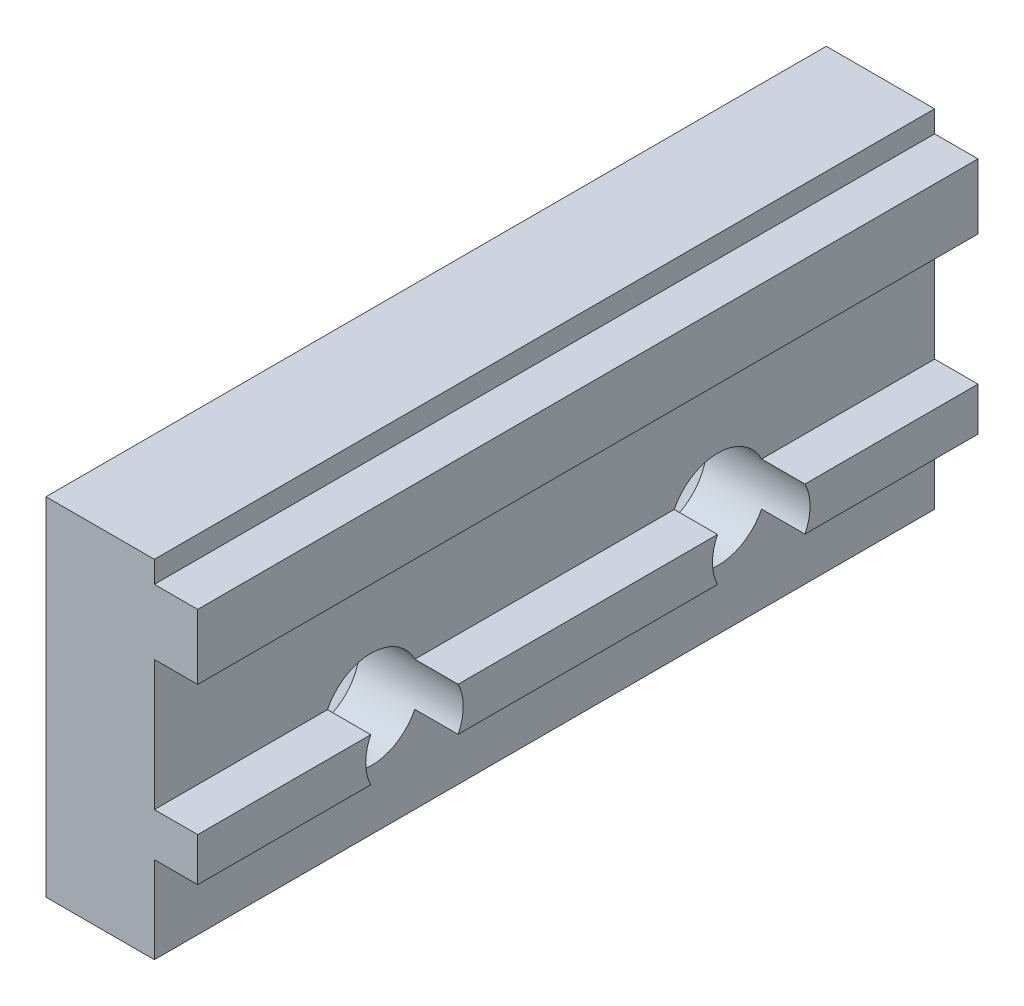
ISO-10303-21;
HEADER;
FILE_DESCRIPTION(('STEP AP214'),'2;1');
FILE_NAME('part.step','',(''),(''),'','','');
FILE_SCHEMA(('AUTOMOTIVE_DESIGN { 1 0 10303 214 1 1 1 1 }'));
ENDSEC;
DATA;
#1=APPLICATION_CONTEXT('core data for automotive mechanical design processes');
#2=APPLICATION_PROTOCOL_DEFINITION('international standard','automotive_design',2000,#1);
#3=PRODUCT_CONTEXT('',#1,'mechanical');
#4=PRODUCT('Part','Part','',(#3));
#5=PRODUCT_RELATED_PRODUCT_CATEGORY('part','',(#4));
#6=PRODUCT_DEFINITION_FORMATION('','',#4);
#7=PRODUCT_DEFINITION_CONTEXT('part definition',#1,'design');
#8=PRODUCT_DEFINITION('design','',#6,#7);
#9=PRODUCT_DEFINITION_SHAPE('','',#8);
#10=(LENGTH_UNIT() NAMED_UNIT(*) SI_UNIT(.MILLI.,.METRE.));
#11=(NAMED_UNIT(*) PLANE_ANGLE_UNIT() SI_UNIT($,.RADIAN.));
#12=(NAMED_UNIT(*) SI_UNIT($,.STERADIAN.) SOLID_ANGLE_UNIT());
#13=UNCERTAINTY_MEASURE_WITH_UNIT(LENGTH_MEASURE(1.E-05),#10,'distance_accuracy_value','');
#14=(GEOMETRIC_REPRESENTATION_CONTEXT(3) GLOBAL_UNCERTAINTY_ASSIGNED_CONTEXT((#13)) GLOBAL_UNIT_ASSIGNED_CONTEXT((#10,
#11,#12)) REPRESENTATION_CONTEXT('',''));
#15=CARTESIAN_POINT('',(0.,0.,0.));
#16=DIRECTION('',(0.,0.,1.));
#17=DIRECTION('',(1.,0.,0.));
#18=AXIS2_PLACEMENT_3D('',#15,#16,#17);
#19=CARTESIAN_POINT('',(0.,-66.7630029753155,-36.));
#20=DIRECTION('',(0.,1.,0.));
#21=DIRECTION('',(0.,0.,1.));
#22=AXIS2_PLACEMENT_3D('',#19,#20,#21);
#23=PLANE('',#22);
#24=DIRECTION('',(-1.,0.,0.));
#25=VECTOR('',#24,1.);
#26=CARTESIAN_POINT('',(-5.,-66.7630029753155,-28.0155644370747));
#27=LINE('',#26,#25);
#28=CARTESIAN_POINT('',(2.,-66.7630029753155,-28.0155644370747));
#29=VERTEX_POINT('',#28);
#30=CARTESIAN_POINT('',(0.,-66.7630029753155,-28.0155644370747));
#31=VERTEX_POINT('',#30);
#32=EDGE_CURVE('E162',#29,#31,#27,.T.);
#33=ORIENTED_EDGE('',*,*,#32,.F.);
#34=DIRECTION('',(0.,0.,1.));
#35=VECTOR('',#34,1.);
#36=CARTESIAN_POINT('',(2.,-66.7630029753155,-36.));
#37=LINE('',#36,#35);
#38=CARTESIAN_POINT('',(2.,-66.7630029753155,-36.));
#39=VERTEX_POINT('',#38);
#40=EDGE_CURVE('E178',#39,#29,#37,.T.);
#41=ORIENTED_EDGE('',*,*,#40,.F.);
#42=DIRECTION('',(-1.,0.,0.));
#43=VECTOR('',#42,1.);
#44=CARTESIAN_POINT('',(0.,-66.7630029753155,-36.));
#45=LINE('',#44,#43);
#46=CARTESIAN_POINT('',(0.,-66.7630029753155,-36.));
#47=VERTEX_POINT('',#46);
#48=EDGE_CURVE('E217',#39,#47,#45,.T.);
#49=ORIENTED_EDGE('',*,*,#48,.T.);
#50=DIRECTION('',(0.,0.,1.));
#51=VECTOR('',#50,1.);
#52=CARTESIAN_POINT('',(0.,-66.7630029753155,-36.));
#53=LINE('',#52,#51);
#54=EDGE_CURVE('E186',#47,#31,#53,.T.);
#55=ORIENTED_EDGE('',*,*,#54,.T.);
#56=EDGE_LOOP('',(#33,#41,#49,#55));
#57=FACE_BOUND('',#56,.T.);
#58=ADVANCED_FACE('F16',(#57),#23,.T.);
#59=CARTESIAN_POINT('',(2.,-66.7630029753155,-36.));
#60=DIRECTION('',(1.,0.,0.));
#61=DIRECTION('',(0.,1.,0.));
#62=AXIS2_PLACEMENT_3D('',#59,#60,#61);
#63=PLANE('',#62);
#64=CARTESIAN_POINT('',(2.,-67.7630029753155,-26.));
#65=DIRECTION('',(-1.,0.,0.));
#66=DIRECTION('',(0.,0.,1.));
#67=AXIS2_PLACEMENT_3D('',#64,#65,#66);
#68=CIRCLE('',#67,2.25);
#69=CARTESIAN_POINT('',(2.,-68.7630029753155,-23.9844355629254));
#70=VERTEX_POINT('',#69);
#71=CARTESIAN_POINT('',(2.,-66.7630029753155,-23.9844355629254));
#72=VERTEX_POINT('',#71);
#73=EDGE_CURVE('E155',#70,#72,#68,.T.);
#74=ORIENTED_EDGE('',*,*,#73,.T.);
#75=CARTESIAN_POINT('',(2.,-66.7630029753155,-12.0155644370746));
#76=VERTEX_POINT('',#75);
#77=EDGE_CURVE('E168',#72,#76,#37,.T.);
#78=ORIENTED_EDGE('',*,*,#77,.T.);
#79=CARTESIAN_POINT('',(2.,-67.7630029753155,-10.));
#80=DIRECTION('',(-1.,0.,0.));
#81=DIRECTION('',(0.,0.,1.));
#82=AXIS2_PLACEMENT_3D('',#79,#80,#81);
#83=CIRCLE('',#82,2.25);
#84=CARTESIAN_POINT('',(2.,-68.7630029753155,-12.0155644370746));
#85=VERTEX_POINT('',#84);
#86=EDGE_CURVE('E323',#76,#85,#83,.T.);
#87=ORIENTED_EDGE('',*,*,#86,.T.);
#88=DIRECTION('',(0.,0.,1.));
#89=VECTOR('',#88,1.);
#90=CARTESIAN_POINT('',(2.,-68.7630029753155,-36.));
#91=LINE('',#90,#89);
#92=EDGE_CURVE('E170',#70,#85,#91,.T.);
#93=ORIENTED_EDGE('',*,*,#92,.F.);
#94=EDGE_LOOP('',(#74,#78,#87,#93));
#95=FACE_BOUND('',#94,.T.);
#96=ADVANCED_FACE('F166',(#95),#63,.T.);
#97=CARTESIAN_POINT('',(0.,-68.7630029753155,-36.));
#98=DIRECTION('',(0.,-1.,0.));
#99=DIRECTION('',(0.,0.,-1.));
#100=AXIS2_PLACEMENT_3D('',#97,#98,#99);
#101=PLANE('',#100);
#102=DIRECTION('',(-1.,0.,0.));
#103=VECTOR('',#102,1.);
#104=CARTESIAN_POINT('',(-5.,-68.7630029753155,-23.9844355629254));
#105=LINE('',#104,#103);
#106=CARTESIAN_POINT('',(0.,-68.7630029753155,-23.9844355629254));
#107=VERTEX_POINT('',#106);
#108=EDGE_CURVE('E11',#70,#107,#105,.T.);
#109=ORIENTED_EDGE('',*,*,#108,.F.);
#110=ORIENTED_EDGE('',*,*,#92,.T.);
#111=DIRECTION('',(-1.,0.,0.));
#112=VECTOR('',#111,1.);
#113=CARTESIAN_POINT('',(-5.,-68.7630029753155,-12.0155644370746));
#114=LINE('',#113,#112);
#115=CARTESIAN_POINT('',(0.,-68.7630029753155,-12.0155644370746));
#116=VERTEX_POINT('',#115);
#117=EDGE_CURVE('E195',#116,#85,#114,.F.);
#118=ORIENTED_EDGE('',*,*,#117,.F.);
#119=DIRECTION('',(0.,0.,1.));
#120=VECTOR('',#119,1.);
#121=CARTESIAN_POINT('',(0.,-68.7630029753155,-36.));
#122=LINE('',#121,#120);
#123=EDGE_CURVE('E37',#107,#116,#122,.T.);
#124=ORIENTED_EDGE('',*,*,#123,.F.);
#125=EDGE_LOOP('',(#109,#110,#118,#124));
#126=FACE_BOUND('',#125,.T.);
#127=ADVANCED_FACE('F384',(#126),#101,.T.);
#128=DIRECTION('',(-1.,0.,0.));
#129=VECTOR('',#128,1.);
#130=CARTESIAN_POINT('',(-5.,-66.7630029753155,-23.9844355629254));
#131=LINE('',#130,#129);
#132=CARTESIAN_POINT('',(0.,-66.7630029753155,-23.9844355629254));
#133=VERTEX_POINT('',#132);
#134=EDGE_CURVE('E151',#133,#72,#131,.F.);
#135=ORIENTED_EDGE('',*,*,#134,.F.);
#136=CARTESIAN_POINT('',(0.,-66.7630029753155,-12.0155644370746));
#137=VERTEX_POINT('',#136);
#138=EDGE_CURVE('E301',#133,#137,#53,.T.);
#139=ORIENTED_EDGE('',*,*,#138,.T.);
#140=DIRECTION('',(-1.,0.,0.));
#141=VECTOR('',#140,1.);
#142=CARTESIAN_POINT('',(-5.,-66.7630029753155,-12.0155644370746));
#143=LINE('',#142,#141);
#144=EDGE_CURVE('E177',#76,#137,#143,.T.);
#145=ORIENTED_EDGE('',*,*,#144,.F.);
#146=ORIENTED_EDGE('',*,*,#77,.F.);
#147=EDGE_LOOP('',(#135,#139,#145,#146));
#148=FACE_BOUND('',#147,.T.);
#149=ADVANCED_FACE('F175',(#148),#23,.T.);
#150=CARTESIAN_POINT('',(2.,-68.7630029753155,-7.98443556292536));
#151=VERTEX_POINT('',#150);
#152=CARTESIAN_POINT('',(2.,-66.7630029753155,-7.98443556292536));
#153=VERTEX_POINT('',#152);
#154=EDGE_CURVE('E320',#151,#153,#83,.T.);
#155=ORIENTED_EDGE('',*,*,#154,.T.);
#156=CARTESIAN_POINT('',(2.,-66.7630029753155,0.));
#157=VERTEX_POINT('',#156);
#158=EDGE_CURVE('E179',#153,#157,#37,.T.);
#159=ORIENTED_EDGE('',*,*,#158,.T.);
#160=DIRECTION('',(0.,1.,0.));
#161=VECTOR('',#160,1.);
#162=CARTESIAN_POINT('',(2.,-66.7630029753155,0.));
#163=LINE('',#162,#161);
#164=CARTESIAN_POINT('',(2.,-68.7630029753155,0.));
#165=VERTEX_POINT('',#164);
#166=EDGE_CURVE('E255',#165,#157,#163,.T.);
#167=ORIENTED_EDGE('',*,*,#166,.F.);
#168=EDGE_CURVE('E190',#151,#165,#91,.T.);
#169=ORIENTED_EDGE('',*,*,#168,.F.);
#170=EDGE_LOOP('',(#155,#159,#167,#169));
#171=FACE_BOUND('',#170,.T.);
#172=ADVANCED_FACE('F319',(#171),#63,.T.);
#173=DIRECTION('',(-1.,0.,0.));
#174=VECTOR('',#173,1.);
#175=CARTESIAN_POINT('',(-5.,-68.7630029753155,-7.98443556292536));
#176=LINE('',#175,#174);
#177=CARTESIAN_POINT('',(0.,-68.7630029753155,-7.98443556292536));
#178=VERTEX_POINT('',#177);
#179=EDGE_CURVE('E198',#151,#178,#176,.T.);
#180=ORIENTED_EDGE('',*,*,#179,.F.);
#181=ORIENTED_EDGE('',*,*,#168,.T.);
#182=DIRECTION('',(1.,0.,0.));
#183=VECTOR('',#182,1.);
#184=CARTESIAN_POINT('',(0.,-68.7630029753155,0.));
#185=LINE('',#184,#183);
#186=CARTESIAN_POINT('',(0.,-68.7630029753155,0.));
#187=VERTEX_POINT('',#186);
#188=EDGE_CURVE('E252',#187,#165,#185,.T.);
#189=ORIENTED_EDGE('',*,*,#188,.F.);
#190=EDGE_CURVE('E194',#178,#187,#122,.T.);
#191=ORIENTED_EDGE('',*,*,#190,.F.);
#192=EDGE_LOOP('',(#180,#181,#189,#191));
#193=FACE_BOUND('',#192,.T.);
#194=ADVANCED_FACE('F470',(#193),#101,.T.);
#195=CARTESIAN_POINT('',(0.,-72.7630029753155,-36.));
#196=DIRECTION('',(1.,0.,0.));
#197=DIRECTION('',(0.,0.,-1.));
#198=AXIS2_PLACEMENT_3D('',#195,#196,#197);
#199=PLANE('',#198);
#200=CARTESIAN_POINT('',(0.,-67.7630029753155,-26.));
#201=DIRECTION('',(1.,0.,0.));
#202=DIRECTION('',(0.,0.,-1.));
#203=AXIS2_PLACEMENT_3D('',#200,#201,#202);
#204=CIRCLE('',#203,2.25);
#205=CARTESIAN_POINT('',(0.,-68.7630029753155,-28.0155644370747));
#206=VERTEX_POINT('',#205);
#207=EDGE_CURVE('E30',#107,#206,#204,.T.);
#208=ORIENTED_EDGE('',*,*,#207,.F.);
#209=ORIENTED_EDGE('',*,*,#123,.T.);
#210=CARTESIAN_POINT('',(0.,-67.7630029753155,-10.));
#211=DIRECTION('',(1.,0.,0.));
#212=DIRECTION('',(0.,0.,-1.));
#213=AXIS2_PLACEMENT_3D('',#210,#211,#212);
#214=CIRCLE('',#213,2.25);
#215=EDGE_CURVE('E326',#178,#116,#214,.T.);
#216=ORIENTED_EDGE('',*,*,#215,.F.);
#217=ORIENTED_EDGE('',*,*,#190,.T.);
#218=DIRECTION('',(0.,1.,0.));
#219=VECTOR('',#218,1.);
#220=CARTESIAN_POINT('',(0.,-72.7630029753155,0.));
#221=LINE('',#220,#219);
#222=CARTESIAN_POINT('',(0.,-72.7630029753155,0.));
#223=VERTEX_POINT('',#222);
#224=EDGE_CURVE('E249',#223,#187,#221,.T.);
#225=ORIENTED_EDGE('',*,*,#224,.F.);
#226=DIRECTION('',(0.,0.,1.));
#227=VECTOR('',#226,1.);
#228=CARTESIAN_POINT('',(0.,-72.7630029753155,-36.));
#229=LINE('',#228,#227);
#230=CARTESIAN_POINT('',(0.,-72.7630029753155,-36.));
#231=VERTEX_POINT('',#230);
#232=EDGE_CURVE('E199',#231,#223,#229,.T.);
#233=ORIENTED_EDGE('',*,*,#232,.F.);
#234=DIRECTION('',(0.,1.,0.));
#235=VECTOR('',#234,1.);
#236=CARTESIAN_POINT('',(0.,-72.7630029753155,-36.));
#237=LINE('',#236,#235);
#238=CARTESIAN_POINT('',(0.,-68.7630029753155,-36.));
#239=VERTEX_POINT('',#238);
#240=EDGE_CURVE('E215',#231,#239,#237,.T.);
#241=ORIENTED_EDGE('',*,*,#240,.T.);
#242=EDGE_CURVE('E191',#239,#206,#122,.T.);
#243=ORIENTED_EDGE('',*,*,#242,.T.);
#244=EDGE_LOOP('',(#208,#209,#216,#217,#225,#233,#241,#243));
#245=FACE_BOUND('',#244,.T.);
#246=ADVANCED_FACE('F18',(#245),#199,.T.);
#247=CARTESIAN_POINT('',(0.,-72.7630029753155,-36.));
#248=DIRECTION('',(0.,-1.,0.));
#249=DIRECTION('',(0.,0.,-1.));
#250=AXIS2_PLACEMENT_3D('',#247,#248,#249);
#251=PLANE('',#250);
#252=DIRECTION('',(1.,0.,0.));
#253=VECTOR('',#252,1.);
#254=CARTESIAN_POINT('',(0.,-72.7630029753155,0.));
#255=LINE('',#254,#253);
#256=CARTESIAN_POINT('',(-5.,-72.7630029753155,0.));
#257=VERTEX_POINT('',#256);
#258=EDGE_CURVE('E219',#257,#223,#255,.T.);
#259=ORIENTED_EDGE('',*,*,#258,.F.);
#260=DIRECTION('',(0.,0.,1.));
#261=VECTOR('',#260,1.);
#262=CARTESIAN_POINT('',(-5.,-72.7630029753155,-36.));
#263=LINE('',#262,#261);
#264=CARTESIAN_POINT('',(-5.,-72.7630029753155,-36.));
#265=VERTEX_POINT('',#264);
#266=EDGE_CURVE('E285',#265,#257,#263,.T.);
#267=ORIENTED_EDGE('',*,*,#266,.F.);
#268=DIRECTION('',(1.,0.,0.));
#269=VECTOR('',#268,1.);
#270=CARTESIAN_POINT('',(0.,-72.7630029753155,-36.));
#271=LINE('',#270,#269);
#272=EDGE_CURVE('E246',#265,#231,#271,.T.);
#273=ORIENTED_EDGE('',*,*,#272,.T.);
#274=ORIENTED_EDGE('',*,*,#232,.T.);
#275=EDGE_LOOP('',(#259,#267,#273,#274));
#276=FACE_BOUND('',#275,.T.);
#277=ADVANCED_FACE('F350',(#276),#251,.T.);
#278=CARTESIAN_POINT('',(-5.,-72.7630029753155,-36.));
#279=DIRECTION('',(-1.,0.,0.));
#280=DIRECTION('',(0.,0.,1.));
#281=AXIS2_PLACEMENT_3D('',#278,#279,#280);
#282=PLANE('',#281);
#283=CARTESIAN_POINT('',(-5.,-67.7630029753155,-26.));
#284=DIRECTION('',(-1.,0.,0.));
#285=DIRECTION('',(0.,0.,1.));
#286=AXIS2_PLACEMENT_3D('',#283,#284,#285);
#287=CIRCLE('',#286,4.48);
#288=CARTESIAN_POINT('',(-5.,-67.7630029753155,-21.52));
#289=VERTEX_POINT('',#288);
#290=EDGE_CURVE('E433',#289,#289,#287,.T.);
#291=ORIENTED_EDGE('',*,*,#290,.F.);
#292=EDGE_LOOP('',(#291));
#293=FACE_BOUND('',#292,.T.);
#294=CARTESIAN_POINT('',(-5.,-67.7630029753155,-10.));
#295=DIRECTION('',(-1.,0.,0.));
#296=DIRECTION('',(0.,0.,1.));
#297=AXIS2_PLACEMENT_3D('',#294,#295,#296);
#298=CIRCLE('',#297,4.48);
#299=CARTESIAN_POINT('',(-5.,-67.7630029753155,-5.52));
#300=VERTEX_POINT('',#299);
#301=EDGE_CURVE('E328',#300,#300,#298,.T.);
#302=ORIENTED_EDGE('',*,*,#301,.F.);
#303=EDGE_LOOP('',(#302));
#304=FACE_BOUND('',#303,.T.);
#305=DIRECTION('',(0.,-1.,0.));
#306=VECTOR('',#305,1.);
#307=CARTESIAN_POINT('',(-5.,-72.7630029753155,0.));
#308=LINE('',#307,#306);
#309=CARTESIAN_POINT('',(-5.,-56.7630029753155,0.));
#310=VERTEX_POINT('',#309);
#311=EDGE_CURVE('E279',#310,#257,#308,.T.);
#312=ORIENTED_EDGE('',*,*,#311,.F.);
#313=DIRECTION('',(0.,0.,1.));
#314=VECTOR('',#313,1.);
#315=CARTESIAN_POINT('',(-5.,-56.7630029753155,-36.));
#316=LINE('',#315,#314);
#317=CARTESIAN_POINT('',(-5.,-56.7630029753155,-36.));
#318=VERTEX_POINT('',#317);
#319=EDGE_CURVE('E287',#318,#310,#316,.T.);
#320=ORIENTED_EDGE('',*,*,#319,.F.);
#321=DIRECTION('',(0.,-1.,0.));
#322=VECTOR('',#321,1.);
#323=CARTESIAN_POINT('',(-5.,-72.7630029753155,-36.));
#324=LINE('',#323,#322);
#325=EDGE_CURVE('E243',#318,#265,#324,.T.);
#326=ORIENTED_EDGE('',*,*,#325,.T.);
#327=ORIENTED_EDGE('',*,*,#266,.T.);
#328=EDGE_LOOP('',(#312,#320,#326,#327));
#329=FACE_BOUND('',#328,.T.);
#330=ADVANCED_FACE('F346',(#293,#304,#329),#282,.T.);
#331=CARTESIAN_POINT('',(0.,-56.7630029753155,-36.));
#332=DIRECTION('',(0.,1.,0.));
#333=DIRECTION('',(0.,0.,1.));
#334=AXIS2_PLACEMENT_3D('',#331,#332,#333);
#335=PLANE('',#334);
#336=DIRECTION('',(-1.,0.,0.));
#337=VECTOR('',#336,1.);
#338=CARTESIAN_POINT('',(0.,-56.7630029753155,0.));
#339=LINE('',#338,#337);
#340=CARTESIAN_POINT('',(0.,-56.7630029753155,0.));
#341=VERTEX_POINT('',#340);
#342=EDGE_CURVE('E276',#341,#310,#339,.T.);
#343=ORIENTED_EDGE('',*,*,#342,.F.);
#344=DIRECTION('',(0.,0.,1.));
#345=VECTOR('',#344,1.);
#346=CARTESIAN_POINT('',(0.,-56.7630029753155,-36.));
#347=LINE('',#346,#345);
#348=CARTESIAN_POINT('',(0.,-56.7630029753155,-36.));
#349=VERTEX_POINT('',#348);
#350=EDGE_CURVE('E289',#349,#341,#347,.T.);
#351=ORIENTED_EDGE('',*,*,#350,.F.);
#352=DIRECTION('',(-1.,0.,0.));
#353=VECTOR('',#352,1.);
#354=CARTESIAN_POINT('',(0.,-56.7630029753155,-36.));
#355=LINE('',#354,#353);
#356=EDGE_CURVE('E240',#349,#318,#355,.T.);
#357=ORIENTED_EDGE('',*,*,#356,.T.);
#358=ORIENTED_EDGE('',*,*,#319,.T.);
#359=EDGE_LOOP('',(#343,#351,#357,#358));
#360=FACE_BOUND('',#359,.T.);
#361=ADVANCED_FACE('F349',(#360),#335,.T.);
#362=CARTESIAN_POINT('',(-1.38777878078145E-13,-57.7630029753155,-36.));
#363=DIRECTION('',(1.,-1.38777878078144E-13,0.));
#364=DIRECTION('',(1.38777878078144E-13,1.,0.));
#365=AXIS2_PLACEMENT_3D('',#362,#363,#364);
#366=PLANE('',#365);
#367=DIRECTION('',(1.38777878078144E-13,1.,0.));
#368=VECTOR('',#367,1.);
#369=CARTESIAN_POINT('',(-1.38777878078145E-13,-57.7630029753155,0.));
#370=LINE('',#369,#368);
#371=CARTESIAN_POINT('',(-1.38777878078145E-13,-57.7630029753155,0.));
#372=VERTEX_POINT('',#371);
#373=EDGE_CURVE('E273',#372,#341,#370,.T.);
#374=ORIENTED_EDGE('',*,*,#373,.F.);
#375=DIRECTION('',(0.,0.,1.));
#376=VECTOR('',#375,1.);
#377=CARTESIAN_POINT('',(-1.38777878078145E-13,-57.7630029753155,-36.));
#378=LINE('',#377,#376);
#379=CARTESIAN_POINT('',(-1.38777878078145E-13,-57.7630029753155,-36.));
#380=VERTEX_POINT('',#379);
#381=EDGE_CURVE('E291',#380,#372,#378,.T.);
#382=ORIENTED_EDGE('',*,*,#381,.F.);
#383=DIRECTION('',(1.38777878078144E-13,1.,0.));
#384=VECTOR('',#383,1.);
#385=CARTESIAN_POINT('',(-1.38777878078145E-13,-57.7630029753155,-36.));
#386=LINE('',#385,#384);
#387=EDGE_CURVE('E237',#380,#349,#386,.T.);
#388=ORIENTED_EDGE('',*,*,#387,.T.);
#389=ORIENTED_EDGE('',*,*,#350,.T.);
#390=EDGE_LOOP('',(#374,#382,#388,#389));
#391=FACE_BOUND('',#390,.T.);
#392=ADVANCED_FACE('F365',(#391),#366,.T.);
#393=CARTESIAN_POINT('',(-1.38777878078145E-13,-57.7630029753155,-36.));
#394=DIRECTION('',(0.,1.,0.));
#395=DIRECTION('',(0.,0.,1.));
#396=AXIS2_PLACEMENT_3D('',#393,#394,#395);
#397=PLANE('',#396);
#398=DIRECTION('',(-1.,0.,0.));
#399=VECTOR('',#398,1.);
#400=CARTESIAN_POINT('',(-1.38777878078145E-13,-57.7630029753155,0.));
#401=LINE('',#400,#399);
#402=CARTESIAN_POINT('',(1.99999999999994,-57.7630029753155,0.));
#403=VERTEX_POINT('',#402);
#404=EDGE_CURVE('E270',#403,#372,#401,.T.);
#405=ORIENTED_EDGE('',*,*,#404,.F.);
#406=DIRECTION('',(0.,0.,1.));
#407=VECTOR('',#406,1.);
#408=CARTESIAN_POINT('',(1.99999999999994,-57.7630029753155,-36.));
#409=LINE('',#408,#407);
#410=CARTESIAN_POINT('',(1.99999999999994,-57.7630029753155,-36.));
#411=VERTEX_POINT('',#410);
#412=EDGE_CURVE('E293',#411,#403,#409,.T.);
#413=ORIENTED_EDGE('',*,*,#412,.F.);
#414=DIRECTION('',(-1.,0.,0.));
#415=VECTOR('',#414,1.);
#416=CARTESIAN_POINT('',(-1.38777878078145E-13,-57.7630029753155,-36.));
#417=LINE('',#416,#415);
#418=EDGE_CURVE('E234',#411,#380,#417,.T.);
#419=ORIENTED_EDGE('',*,*,#418,.T.);
#420=ORIENTED_EDGE('',*,*,#381,.T.);
#421=EDGE_LOOP('',(#405,#413,#419,#420));
#422=FACE_BOUND('',#421,.T.);
#423=ADVANCED_FACE('F368',(#422),#397,.T.);
#424=CARTESIAN_POINT('',(1.99999999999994,-57.7630029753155,-36.));
#425=DIRECTION('',(1.,0.,0.));
#426=DIRECTION('',(0.,0.,-1.));
#427=AXIS2_PLACEMENT_3D('',#424,#425,#426);
#428=PLANE('',#427);
#429=DIRECTION('',(0.,1.,0.));
#430=VECTOR('',#429,1.);
#431=CARTESIAN_POINT('',(1.99999999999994,-57.7630029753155,0.));
#432=LINE('',#431,#430);
#433=CARTESIAN_POINT('',(1.99999999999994,-60.7630029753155,0.));
#434=VERTEX_POINT('',#433);
#435=EDGE_CURVE('E267',#434,#403,#432,.T.);
#436=ORIENTED_EDGE('',*,*,#435,.F.);
#437=DIRECTION('',(0.,0.,1.));
#438=VECTOR('',#437,1.);
#439=CARTESIAN_POINT('',(1.99999999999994,-60.7630029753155,-36.));
#440=LINE('',#439,#438);
#441=CARTESIAN_POINT('',(1.99999999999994,-60.7630029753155,-36.));
#442=VERTEX_POINT('',#441);
#443=EDGE_CURVE('E295',#442,#434,#440,.T.);
#444=ORIENTED_EDGE('',*,*,#443,.F.);
#445=DIRECTION('',(0.,1.,0.));
#446=VECTOR('',#445,1.);
#447=CARTESIAN_POINT('',(1.99999999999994,-57.7630029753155,-36.));
#448=LINE('',#447,#446);
#449=EDGE_CURVE('E231',#442,#411,#448,.T.);
#450=ORIENTED_EDGE('',*,*,#449,.T.);
#451=ORIENTED_EDGE('',*,*,#412,.T.);
#452=EDGE_LOOP('',(#436,#444,#450,#451));
#453=FACE_BOUND('',#452,.T.);
#454=ADVANCED_FACE('F373',(#453),#428,.T.);
#455=CARTESIAN_POINT('',(-1.38777878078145E-13,-60.7630029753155,-36.));
#456=DIRECTION('',(0.,-1.,0.));
#457=DIRECTION('',(0.,0.,-1.));
#458=AXIS2_PLACEMENT_3D('',#455,#456,#457);
#459=PLANE('',#458);
#460=DIRECTION('',(1.,0.,0.));
#461=VECTOR('',#460,1.);
#462=CARTESIAN_POINT('',(-1.38777878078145E-13,-60.7630029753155,0.));
#463=LINE('',#462,#461);
#464=CARTESIAN_POINT('',(-1.38777878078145E-13,-60.7630029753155,0.));
#465=VERTEX_POINT('',#464);
#466=EDGE_CURVE('E264',#465,#434,#463,.T.);
#467=ORIENTED_EDGE('',*,*,#466,.F.);
#468=DIRECTION('',(0.,0.,1.));
#469=VECTOR('',#468,1.);
#470=CARTESIAN_POINT('',(-1.38777878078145E-13,-60.7630029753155,-36.));
#471=LINE('',#470,#469);
#472=CARTESIAN_POINT('',(-1.38777878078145E-13,-60.7630029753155,-36.));
#473=VERTEX_POINT('',#472);
#474=EDGE_CURVE('E296',#473,#465,#471,.T.);
#475=ORIENTED_EDGE('',*,*,#474,.F.);
#476=DIRECTION('',(1.,0.,0.));
#477=VECTOR('',#476,1.);
#478=CARTESIAN_POINT('',(-1.38777878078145E-13,-60.7630029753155,-36.));
#479=LINE('',#478,#477);
#480=EDGE_CURVE('E228',#473,#442,#479,.T.);
#481=ORIENTED_EDGE('',*,*,#480,.T.);
#482=ORIENTED_EDGE('',*,*,#443,.T.);
#483=EDGE_LOOP('',(#467,#475,#481,#482));
#484=FACE_BOUND('',#483,.T.);
#485=ADVANCED_FACE('F375',(#484),#459,.T.);
#486=CARTESIAN_POINT('',(0.,-66.7630029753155,-36.));
#487=DIRECTION('',(1.,0.,0.));
#488=DIRECTION('',(0.,1.,0.));
#489=AXIS2_PLACEMENT_3D('',#486,#487,#488);
#490=PLANE('',#489);
#491=CARTESIAN_POINT('',(0.,-67.7630029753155,-26.));
#492=DIRECTION('',(1.,0.,0.));
#493=DIRECTION('',(0.,1.,0.));
#494=AXIS2_PLACEMENT_3D('',#491,#492,#493);
#495=CIRCLE('',#494,2.25);
#496=EDGE_CURVE('E158',#31,#133,#495,.T.);
#497=ORIENTED_EDGE('',*,*,#496,.F.);
#498=ORIENTED_EDGE('',*,*,#54,.F.);
#499=DIRECTION('',(0.,1.,0.));
#500=VECTOR('',#499,1.);
#501=CARTESIAN_POINT('',(0.,-66.7630029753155,-36.));
#502=LINE('',#501,#500);
#503=EDGE_CURVE('E225',#47,#473,#502,.T.);
#504=ORIENTED_EDGE('',*,*,#503,.T.);
#505=ORIENTED_EDGE('',*,*,#474,.T.);
#506=DIRECTION('',(0.,1.,0.));
#507=VECTOR('',#506,1.);
#508=CARTESIAN_POINT('',(0.,-66.7630029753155,0.));
#509=LINE('',#508,#507);
#510=CARTESIAN_POINT('',(0.,-66.7630029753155,0.));
#511=VERTEX_POINT('',#510);
#512=EDGE_CURVE('E261',#511,#465,#509,.T.);
#513=ORIENTED_EDGE('',*,*,#512,.F.);
#514=CARTESIAN_POINT('',(0.,-66.7630029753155,-7.98443556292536));
#515=VERTEX_POINT('',#514);
#516=EDGE_CURVE('E182',#515,#511,#53,.T.);
#517=ORIENTED_EDGE('',*,*,#516,.F.);
#518=CARTESIAN_POINT('',(0.,-67.7630029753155,-10.));
#519=DIRECTION('',(1.,0.,0.));
#520=DIRECTION('',(0.,1.,0.));
#521=AXIS2_PLACEMENT_3D('',#518,#519,#520);
#522=CIRCLE('',#521,2.25);
#523=EDGE_CURVE('E334',#137,#515,#522,.T.);
#524=ORIENTED_EDGE('',*,*,#523,.F.);
#525=ORIENTED_EDGE('',*,*,#138,.F.);
#526=EDGE_LOOP('',(#497,#498,#504,#505,#513,#517,#524,#525));
#527=FACE_BOUND('',#526,.T.);
#528=ADVANCED_FACE('F311',(#527),#490,.T.);
#529=DIRECTION('',(-1.,0.,0.));
#530=VECTOR('',#529,1.);
#531=CARTESIAN_POINT('',(-5.,-66.7630029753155,-7.98443556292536));
#532=LINE('',#531,#530);
#533=EDGE_CURVE('E309',#515,#153,#532,.F.);
#534=ORIENTED_EDGE('',*,*,#533,.F.);
#535=ORIENTED_EDGE('',*,*,#516,.T.);
#536=DIRECTION('',(-1.,0.,0.));
#537=VECTOR('',#536,1.);
#538=CARTESIAN_POINT('',(0.,-66.7630029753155,0.));
#539=LINE('',#538,#537);
#540=EDGE_CURVE('E258',#157,#511,#539,.T.);
#541=ORIENTED_EDGE('',*,*,#540,.F.);
#542=ORIENTED_EDGE('',*,*,#158,.F.);
#543=EDGE_LOOP('',(#534,#535,#541,#542));
#544=FACE_BOUND('',#543,.T.);
#545=ADVANCED_FACE('F307',(#544),#23,.T.);
#546=CARTESIAN_POINT('',(2.,-68.7630029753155,-28.0155644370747));
#547=VERTEX_POINT('',#546);
#548=EDGE_CURVE('E171',#29,#547,#68,.T.);
#549=ORIENTED_EDGE('',*,*,#548,.T.);
#550=CARTESIAN_POINT('',(2.,-68.7630029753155,-36.));
#551=VERTEX_POINT('',#550);
#552=EDGE_CURVE('E183',#551,#547,#91,.T.);
#553=ORIENTED_EDGE('',*,*,#552,.F.);
#554=DIRECTION('',(0.,1.,0.));
#555=VECTOR('',#554,1.);
#556=CARTESIAN_POINT('',(2.,-66.7630029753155,-36.));
#557=LINE('',#556,#555);
#558=EDGE_CURVE('E214',#551,#39,#557,.T.);
#559=ORIENTED_EDGE('',*,*,#558,.T.);
#560=ORIENTED_EDGE('',*,*,#40,.T.);
#561=EDGE_LOOP('',(#549,#553,#559,#560));
#562=FACE_BOUND('',#561,.T.);
#563=ADVANCED_FACE('F204',(#562),#63,.T.);
#564=DIRECTION('',(-1.,0.,0.));
#565=VECTOR('',#564,1.);
#566=CARTESIAN_POINT('',(-5.,-68.7630029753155,-28.0155644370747));
#567=LINE('',#566,#565);
#568=EDGE_CURVE('E24',#206,#547,#567,.F.);
#569=ORIENTED_EDGE('',*,*,#568,.F.);
#570=ORIENTED_EDGE('',*,*,#242,.F.);
#571=DIRECTION('',(1.,0.,0.));
#572=VECTOR('',#571,1.);
#573=CARTESIAN_POINT('',(0.,-68.7630029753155,-36.));
#574=LINE('',#573,#572);
#575=EDGE_CURVE('E210',#239,#551,#574,.T.);
#576=ORIENTED_EDGE('',*,*,#575,.T.);
#577=ORIENTED_EDGE('',*,*,#552,.T.);
#578=EDGE_LOOP('',(#569,#570,#576,#577));
#579=FACE_BOUND('',#578,.T.);
#580=ADVANCED_FACE('F208',(#579),#101,.T.);
#581=CARTESIAN_POINT('',(0.,0.,-36.));
#582=DIRECTION('',(0.,0.,-1.));
#583=DIRECTION('',(-1.,0.,0.));
#584=AXIS2_PLACEMENT_3D('',#581,#582,#583);
#585=PLANE('',#584);
#586=ORIENTED_EDGE('',*,*,#240,.F.);
#587=ORIENTED_EDGE('',*,*,#272,.F.);
#588=ORIENTED_EDGE('',*,*,#325,.F.);
#589=ORIENTED_EDGE('',*,*,#356,.F.);
#590=ORIENTED_EDGE('',*,*,#387,.F.);
#591=ORIENTED_EDGE('',*,*,#418,.F.);
#592=ORIENTED_EDGE('',*,*,#449,.F.);
#593=ORIENTED_EDGE('',*,*,#480,.F.);
#594=ORIENTED_EDGE('',*,*,#503,.F.);
#595=ORIENTED_EDGE('',*,*,#48,.F.);
#596=ORIENTED_EDGE('',*,*,#558,.F.);
#597=ORIENTED_EDGE('',*,*,#575,.F.);
#598=EDGE_LOOP('',(#586,#587,#588,#589,#590,#591,#592,#593,#594,#595,#596,#597));
#599=FACE_BOUND('',#598,.T.);
#600=ADVANCED_FACE('F361',(#599),#585,.T.);
#601=CARTESIAN_POINT('',(0.,0.,0.));
#602=DIRECTION('',(0.,0.,-1.));
#603=DIRECTION('',(-1.,0.,0.));
#604=AXIS2_PLACEMENT_3D('',#601,#602,#603);
#605=PLANE('',#604);
#606=ORIENTED_EDGE('',*,*,#224,.T.);
#607=ORIENTED_EDGE('',*,*,#188,.T.);
#608=ORIENTED_EDGE('',*,*,#166,.T.);
#609=ORIENTED_EDGE('',*,*,#540,.T.);
#610=ORIENTED_EDGE('',*,*,#512,.T.);
#611=ORIENTED_EDGE('',*,*,#466,.T.);
#612=ORIENTED_EDGE('',*,*,#435,.T.);
#613=ORIENTED_EDGE('',*,*,#404,.T.);
#614=ORIENTED_EDGE('',*,*,#373,.T.);
#615=ORIENTED_EDGE('',*,*,#342,.T.);
#616=ORIENTED_EDGE('',*,*,#311,.T.);
#617=ORIENTED_EDGE('',*,*,#258,.T.);
#618=EDGE_LOOP('',(#606,#607,#608,#609,#610,#611,#612,#613,#614,#615,#616,#617));
#619=FACE_BOUND('',#618,.T.);
#620=ADVANCED_FACE('F313',(#619),#605,.F.);
#621=CARTESIAN_POINT('',(-5.,-67.7630029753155,-10.));
#622=DIRECTION('',(-1.,0.,0.));
#623=DIRECTION('',(0.,0.,1.));
#624=AXIS2_PLACEMENT_3D('',#621,#622,#623);
#625=CYLINDRICAL_SURFACE('',#624,2.25);
#626=ORIENTED_EDGE('',*,*,#144,.T.);
#627=ORIENTED_EDGE('',*,*,#523,.T.);
#628=ORIENTED_EDGE('',*,*,#533,.T.);
#629=ORIENTED_EDGE('',*,*,#154,.F.);
#630=ORIENTED_EDGE('',*,*,#179,.T.);
#631=ORIENTED_EDGE('',*,*,#215,.T.);
#632=ORIENTED_EDGE('',*,*,#117,.T.);
#633=ORIENTED_EDGE('',*,*,#86,.F.);
#634=EDGE_LOOP('',(#626,#627,#628,#629,#630,#631,#632,#633));
#635=FACE_BOUND('',#634,.T.);
#636=CARTESIAN_POINT('',(-2.77,-67.7630029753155,-10.));
#637=DIRECTION('',(-1.,0.,0.));
#638=DIRECTION('',(0.,0.,1.));
#639=AXIS2_PLACEMENT_3D('',#636,#637,#638);
#640=CIRCLE('',#639,2.25);
#641=CARTESIAN_POINT('',(-2.77,-67.7630029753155,-7.75));
#642=VERTEX_POINT('',#641);
#643=EDGE_CURVE('E324',#642,#642,#640,.T.);
#644=ORIENTED_EDGE('',*,*,#643,.T.);
#645=EDGE_LOOP('',(#644));
#646=FACE_BOUND('',#645,.T.);
#647=ADVANCED_FACE('F335',(#635,#646),#625,.F.);
#648=CARTESIAN_POINT('',(-5.,-67.7630029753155,-10.));
#649=DIRECTION('',(-1.,0.,0.));
#650=DIRECTION('',(0.,0.,1.));
#651=AXIS2_PLACEMENT_3D('',#648,#649,#650);
#652=CONICAL_SURFACE('',#651,4.48,0.785398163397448);
#653=ORIENTED_EDGE('',*,*,#643,.F.);
#654=EDGE_LOOP('',(#653));
#655=FACE_BOUND('',#654,.T.);
#656=ORIENTED_EDGE('',*,*,#301,.T.);
#657=EDGE_LOOP('',(#656));
#658=FACE_BOUND('',#657,.T.);
#659=ADVANCED_FACE('F344',(#655,#658),#652,.F.);
#660=CARTESIAN_POINT('',(-5.,-67.7630029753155,-26.));
#661=DIRECTION('',(-1.,0.,0.));
#662=DIRECTION('',(0.,0.,1.));
#663=AXIS2_PLACEMENT_3D('',#660,#661,#662);
#664=CYLINDRICAL_SURFACE('',#663,2.25);
#665=ORIENTED_EDGE('',*,*,#32,.T.);
#666=ORIENTED_EDGE('',*,*,#496,.T.);
#667=ORIENTED_EDGE('',*,*,#134,.T.);
#668=ORIENTED_EDGE('',*,*,#73,.F.);
#669=ORIENTED_EDGE('',*,*,#108,.T.);
#670=ORIENTED_EDGE('',*,*,#207,.T.);
#671=ORIENTED_EDGE('',*,*,#568,.T.);
#672=ORIENTED_EDGE('',*,*,#548,.F.);
#673=EDGE_LOOP('',(#665,#666,#667,#668,#669,#670,#671,#672));
#674=FACE_BOUND('',#673,.T.);
#675=CARTESIAN_POINT('',(-2.77,-67.7630029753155,-26.));
#676=DIRECTION('',(-1.,0.,0.));
#677=DIRECTION('',(0.,0.,1.));
#678=AXIS2_PLACEMENT_3D('',#675,#676,#677);
#679=CIRCLE('',#678,2.25);
#680=CARTESIAN_POINT('',(-2.77,-67.7630029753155,-23.75));
#681=VERTEX_POINT('',#680);
#682=EDGE_CURVE('E172',#681,#681,#679,.T.);
#683=ORIENTED_EDGE('',*,*,#682,.T.);
#684=EDGE_LOOP('',(#683));
#685=FACE_BOUND('',#684,.T.);
#686=ADVANCED_FACE('F153',(#674,#685),#664,.F.);
#687=CARTESIAN_POINT('',(-5.,-67.7630029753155,-26.));
#688=DIRECTION('',(-1.,0.,0.));
#689=DIRECTION('',(0.,0.,1.));
#690=AXIS2_PLACEMENT_3D('',#687,#688,#689);
#691=CONICAL_SURFACE('',#690,4.48,0.785398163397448);
#692=ORIENTED_EDGE('',*,*,#682,.F.);
#693=EDGE_LOOP('',(#692));
#694=FACE_BOUND('',#693,.T.);
#695=ORIENTED_EDGE('',*,*,#290,.T.);
#696=EDGE_LOOP('',(#695));
#697=FACE_BOUND('',#696,.T.);
#698=ADVANCED_FACE('F422',(#694,#697),#691,.F.);
#699=CLOSED_SHELL('',(#58,#96,#127,#149,#172,#194,#246,#277,#330,#361,#392,#423,#454,#485,#528,
#545,#563,#580,#600,#620,#647,#659,#686,#698));
#700=MANIFOLD_SOLID_BREP('B1',#699);
#701=ADVANCED_BREP_SHAPE_REPRESENTATION('',(#18,#700),#14);
#702=SHAPE_DEFINITION_REPRESENTATION(#9,#701);
ENDSEC;
END-ISO-10303-21;
